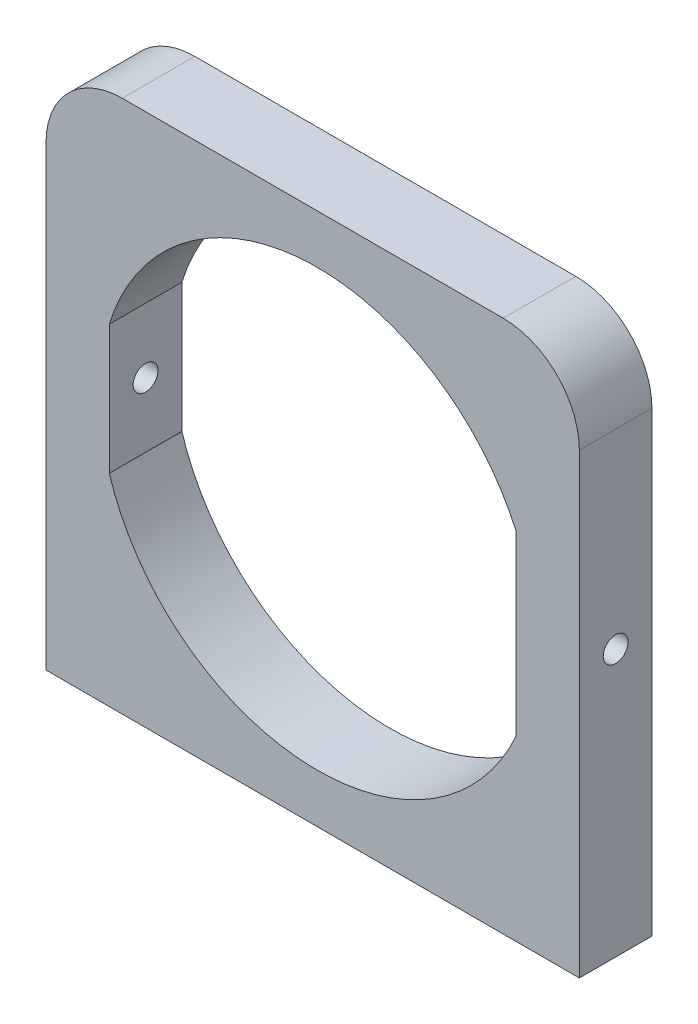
ISO-10303-21;
HEADER;
FILE_DESCRIPTION(('STEP AP214'),'2;1');
FILE_NAME('part.step','',(''),(''),'','','');
FILE_SCHEMA(('AUTOMOTIVE_DESIGN { 1 0 10303 214 1 1 1 1 }'));
ENDSEC;
DATA;
#1=APPLICATION_CONTEXT('core data for automotive mechanical design processes');
#2=APPLICATION_PROTOCOL_DEFINITION('international standard','automotive_design',2000,#1);
#3=PRODUCT_CONTEXT('',#1,'mechanical');
#4=PRODUCT('Part','Part','',(#3));
#5=PRODUCT_RELATED_PRODUCT_CATEGORY('part','',(#4));
#6=PRODUCT_DEFINITION_FORMATION('','',#4);
#7=PRODUCT_DEFINITION_CONTEXT('part definition',#1,'design');
#8=PRODUCT_DEFINITION('design','',#6,#7);
#9=PRODUCT_DEFINITION_SHAPE('','',#8);
#10=(LENGTH_UNIT() NAMED_UNIT(*) SI_UNIT(.MILLI.,.METRE.));
#11=(NAMED_UNIT(*) PLANE_ANGLE_UNIT() SI_UNIT($,.RADIAN.));
#12=(NAMED_UNIT(*) SI_UNIT($,.STERADIAN.) SOLID_ANGLE_UNIT());
#13=UNCERTAINTY_MEASURE_WITH_UNIT(LENGTH_MEASURE(1.E-05),#10,'distance_accuracy_value','');
#14=(GEOMETRIC_REPRESENTATION_CONTEXT(3) GLOBAL_UNCERTAINTY_ASSIGNED_CONTEXT((#13)) GLOBAL_UNIT_ASSIGNED_CONTEXT((#10,
#11,#12)) REPRESENTATION_CONTEXT('',''));
#15=CARTESIAN_POINT('',(0.,0.,0.));
#16=DIRECTION('',(0.,0.,1.));
#17=DIRECTION('',(1.,0.,0.));
#18=AXIS2_PLACEMENT_3D('',#15,#16,#17);
#19=CARTESIAN_POINT('',(-35.,0.,4.7625));
#20=DIRECTION('',(-1.,0.,0.));
#21=DIRECTION('',(0.,0.,1.));
#22=AXIS2_PLACEMENT_3D('',#19,#20,#21);
#23=CYLINDRICAL_SURFACE('',#22,1.63194999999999);
#24=CARTESIAN_POINT('',(26.7,0.,4.7625));
#25=DIRECTION('',(1.,0.,0.));
#26=DIRECTION('',(0.,1.,0.));
#27=AXIS2_PLACEMENT_3D('',#24,#25,#26);
#28=CIRCLE('',#27,1.63194999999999);
#29=CARTESIAN_POINT('',(26.7,1.63194999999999,4.7625));
#30=VERTEX_POINT('',#29);
#31=EDGE_CURVE('E149',#30,#30,#28,.T.);
#32=ORIENTED_EDGE('',*,*,#31,.F.);
#33=EDGE_LOOP('',(#32));
#34=FACE_BOUND('',#33,.T.);
#35=CARTESIAN_POINT('',(35.,0.,4.7625));
#36=DIRECTION('',(-1.,0.,0.));
#37=DIRECTION('',(0.,0.,1.));
#38=AXIS2_PLACEMENT_3D('',#35,#36,#37);
#39=CIRCLE('',#38,1.63194999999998);
#40=CARTESIAN_POINT('',(35.,0.,6.39444999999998));
#41=VERTEX_POINT('',#40);
#42=EDGE_CURVE('E203',#41,#41,#39,.T.);
#43=ORIENTED_EDGE('',*,*,#42,.F.);
#44=EDGE_LOOP('',(#43));
#45=FACE_BOUND('',#44,.T.);
#46=ADVANCED_FACE('F37',(#34,#45),#23,.F.);
#47=CARTESIAN_POINT('',(-35.,-35.,9.525));
#48=DIRECTION('',(1.,0.,0.));
#49=DIRECTION('',(0.,0.,-1.));
#50=AXIS2_PLACEMENT_3D('',#47,#48,#49);
#51=PLANE('',#50);
#52=CARTESIAN_POINT('',(-35.,0.,4.7625));
#53=DIRECTION('',(-1.,0.,0.));
#54=DIRECTION('',(0.,0.,1.));
#55=AXIS2_PLACEMENT_3D('',#52,#53,#54);
#56=CIRCLE('',#55,1.63194999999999);
#57=CARTESIAN_POINT('',(-35.,0.,6.39444999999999));
#58=VERTEX_POINT('',#57);
#59=EDGE_CURVE('E200',#58,#58,#56,.T.);
#60=ORIENTED_EDGE('',*,*,#59,.F.);
#61=EDGE_LOOP('',(#60));
#62=FACE_BOUND('',#61,.T.);
#63=DIRECTION('',(0.,-1.,0.));
#64=VECTOR('',#63,1.);
#65=CARTESIAN_POINT('',(-35.,-35.,9.525));
#66=LINE('',#65,#64);
#67=CARTESIAN_POINT('',(-35.,25.,9.525));
#68=VERTEX_POINT('',#67);
#69=CARTESIAN_POINT('',(-35.,-35.,9.525));
#70=VERTEX_POINT('',#69);
#71=EDGE_CURVE('E207',#68,#70,#66,.T.);
#72=ORIENTED_EDGE('',*,*,#71,.F.);
#73=DIRECTION('',(0.,0.,-1.));
#74=VECTOR('',#73,1.);
#75=CARTESIAN_POINT('',(-35.,25.,9.525));
#76=LINE('',#75,#74);
#77=CARTESIAN_POINT('',(-35.,25.,0.));
#78=VERTEX_POINT('',#77);
#79=EDGE_CURVE('E11',#68,#78,#76,.T.);
#80=ORIENTED_EDGE('',*,*,#79,.T.);
#81=DIRECTION('',(0.,-1.,0.));
#82=VECTOR('',#81,1.);
#83=CARTESIAN_POINT('',(-35.,-35.,0.));
#84=LINE('',#83,#82);
#85=CARTESIAN_POINT('',(-35.,-35.,0.));
#86=VERTEX_POINT('',#85);
#87=EDGE_CURVE('E206',#78,#86,#84,.T.);
#88=ORIENTED_EDGE('',*,*,#87,.T.);
#89=DIRECTION('',(0.,0.,-1.));
#90=VECTOR('',#89,1.);
#91=CARTESIAN_POINT('',(-35.,-35.,9.525));
#92=LINE('',#91,#90);
#93=EDGE_CURVE('E226',#70,#86,#92,.T.);
#94=ORIENTED_EDGE('',*,*,#93,.F.);
#95=EDGE_LOOP('',(#72,#80,#88,#94));
#96=FACE_BOUND('',#95,.T.);
#97=ADVANCED_FACE('F259',(#62,#96),#51,.F.);
#98=CARTESIAN_POINT('',(35.,-35.,9.525));
#99=DIRECTION('',(0.,1.,0.));
#100=DIRECTION('',(-1.,0.,0.));
#101=AXIS2_PLACEMENT_3D('',#98,#99,#100);
#102=PLANE('',#101);
#103=CARTESIAN_POINT('',(-15.95,-35.,4.7625));
#104=DIRECTION('',(0.,-1.,0.));
#105=DIRECTION('',(0.,0.,-1.));
#106=AXIS2_PLACEMENT_3D('',#103,#104,#105);
#107=CIRCLE('',#106,1.5875);
#108=CARTESIAN_POINT('',(-15.95,-35.,3.175));
#109=VERTEX_POINT('',#108);
#110=EDGE_CURVE('E176',#109,#109,#107,.T.);
#111=ORIENTED_EDGE('',*,*,#110,.F.);
#112=EDGE_LOOP('',(#111));
#113=FACE_BOUND('',#112,.T.);
#114=CARTESIAN_POINT('',(15.95,-35.,4.7625));
#115=DIRECTION('',(0.,-1.,0.));
#116=DIRECTION('',(0.,0.,-1.));
#117=AXIS2_PLACEMENT_3D('',#114,#115,#116);
#118=CIRCLE('',#117,1.5875);
#119=CARTESIAN_POINT('',(15.95,-35.,3.175));
#120=VERTEX_POINT('',#119);
#121=EDGE_CURVE('E182',#120,#120,#118,.T.);
#122=ORIENTED_EDGE('',*,*,#121,.F.);
#123=EDGE_LOOP('',(#122));
#124=FACE_BOUND('',#123,.T.);
#125=CARTESIAN_POINT('',(-28.65,-35.,4.7625));
#126=DIRECTION('',(0.,-1.,0.));
#127=DIRECTION('',(0.,0.,-1.));
#128=AXIS2_PLACEMENT_3D('',#125,#126,#127);
#129=CIRCLE('',#128,1.7272);
#130=CARTESIAN_POINT('',(-28.65,-35.,3.0353));
#131=VERTEX_POINT('',#130);
#132=EDGE_CURVE('E188',#131,#131,#129,.T.);
#133=ORIENTED_EDGE('',*,*,#132,.F.);
#134=EDGE_LOOP('',(#133));
#135=FACE_BOUND('',#134,.T.);
#136=CARTESIAN_POINT('',(28.65,-35.,4.7625));
#137=DIRECTION('',(0.,-1.,0.));
#138=DIRECTION('',(0.,0.,-1.));
#139=AXIS2_PLACEMENT_3D('',#136,#137,#138);
#140=CIRCLE('',#139,1.7272);
#141=CARTESIAN_POINT('',(28.65,-35.,3.0353));
#142=VERTEX_POINT('',#141);
#143=EDGE_CURVE('E194',#142,#142,#140,.T.);
#144=ORIENTED_EDGE('',*,*,#143,.F.);
#145=EDGE_LOOP('',(#144));
#146=FACE_BOUND('',#145,.T.);
#147=DIRECTION('',(1.,0.,0.));
#148=VECTOR('',#147,1.);
#149=CARTESIAN_POINT('',(35.,-35.,0.));
#150=LINE('',#149,#148);
#151=CARTESIAN_POINT('',(35.,-35.,0.));
#152=VERTEX_POINT('',#151);
#153=EDGE_CURVE('E218',#86,#152,#150,.T.);
#154=ORIENTED_EDGE('',*,*,#153,.T.);
#155=DIRECTION('',(0.,0.,-1.));
#156=VECTOR('',#155,1.);
#157=CARTESIAN_POINT('',(35.,-35.,9.525));
#158=LINE('',#157,#156);
#159=CARTESIAN_POINT('',(35.,-35.,9.525));
#160=VERTEX_POINT('',#159);
#161=EDGE_CURVE('E216',#160,#152,#158,.T.);
#162=ORIENTED_EDGE('',*,*,#161,.F.);
#163=DIRECTION('',(1.,0.,0.));
#164=VECTOR('',#163,1.);
#165=CARTESIAN_POINT('',(35.,-35.,9.525));
#166=LINE('',#165,#164);
#167=EDGE_CURVE('E209',#70,#160,#166,.T.);
#168=ORIENTED_EDGE('',*,*,#167,.F.);
#169=ORIENTED_EDGE('',*,*,#93,.T.);
#170=EDGE_LOOP('',(#154,#162,#168,#169));
#171=FACE_BOUND('',#170,.T.);
#172=ADVANCED_FACE('F255',(#113,#124,#135,#146,#171),#102,.F.);
#173=CARTESIAN_POINT('',(35.,-35.,9.525));
#174=DIRECTION('',(-1.,0.,0.));
#175=DIRECTION('',(0.,0.,1.));
#176=AXIS2_PLACEMENT_3D('',#173,#174,#175);
#177=PLANE('',#176);
#178=ORIENTED_EDGE('',*,*,#42,.T.);
#179=EDGE_LOOP('',(#178));
#180=FACE_BOUND('',#179,.T.);
#181=DIRECTION('',(0.,1.,0.));
#182=VECTOR('',#181,1.);
#183=CARTESIAN_POINT('',(35.,-35.,0.));
#184=LINE('',#183,#182);
#185=CARTESIAN_POINT('',(35.,25.,0.));
#186=VERTEX_POINT('',#185);
#187=EDGE_CURVE('E220',#152,#186,#184,.T.);
#188=ORIENTED_EDGE('',*,*,#187,.T.);
#189=DIRECTION('',(0.,0.,-1.));
#190=VECTOR('',#189,1.);
#191=CARTESIAN_POINT('',(35.,25.,9.525));
#192=LINE('',#191,#190);
#193=CARTESIAN_POINT('',(35.,25.,9.525));
#194=VERTEX_POINT('',#193);
#195=EDGE_CURVE('E60',#186,#194,#192,.F.);
#196=ORIENTED_EDGE('',*,*,#195,.T.);
#197=DIRECTION('',(0.,1.,0.));
#198=VECTOR('',#197,1.);
#199=CARTESIAN_POINT('',(35.,-35.,9.525));
#200=LINE('',#199,#198);
#201=EDGE_CURVE('E212',#160,#194,#200,.T.);
#202=ORIENTED_EDGE('',*,*,#201,.F.);
#203=ORIENTED_EDGE('',*,*,#161,.T.);
#204=EDGE_LOOP('',(#188,#196,#202,#203));
#205=FACE_BOUND('',#204,.T.);
#206=ADVANCED_FACE('F251',(#180,#205),#177,.F.);
#207=CARTESIAN_POINT('',(35.,35.,9.525));
#208=DIRECTION('',(0.,-1.,0.));
#209=DIRECTION('',(1.,0.,0.));
#210=AXIS2_PLACEMENT_3D('',#207,#208,#209);
#211=PLANE('',#210);
#212=DIRECTION('',(-1.,0.,0.));
#213=VECTOR('',#212,1.);
#214=CARTESIAN_POINT('',(35.,35.,9.525));
#215=LINE('',#214,#213);
#216=CARTESIAN_POINT('',(25.,35.,9.525));
#217=VERTEX_POINT('',#216);
#218=CARTESIAN_POINT('',(-25.,35.,9.525));
#219=VERTEX_POINT('',#218);
#220=EDGE_CURVE('E214',#217,#219,#215,.T.);
#221=ORIENTED_EDGE('',*,*,#220,.F.);
#222=DIRECTION('',(0.,0.,-1.));
#223=VECTOR('',#222,1.);
#224=CARTESIAN_POINT('',(25.,35.,9.525));
#225=LINE('',#224,#223);
#226=CARTESIAN_POINT('',(25.,35.,0.));
#227=VERTEX_POINT('',#226);
#228=EDGE_CURVE('E231',#217,#227,#225,.T.);
#229=ORIENTED_EDGE('',*,*,#228,.T.);
#230=DIRECTION('',(-1.,0.,0.));
#231=VECTOR('',#230,1.);
#232=CARTESIAN_POINT('',(35.,35.,0.));
#233=LINE('',#232,#231);
#234=CARTESIAN_POINT('',(-25.,35.,0.));
#235=VERTEX_POINT('',#234);
#236=EDGE_CURVE('E210',#227,#235,#233,.T.);
#237=ORIENTED_EDGE('',*,*,#236,.T.);
#238=DIRECTION('',(0.,0.,-1.));
#239=VECTOR('',#238,1.);
#240=CARTESIAN_POINT('',(-25.,35.,9.525));
#241=LINE('',#240,#239);
#242=EDGE_CURVE('E229',#235,#219,#241,.F.);
#243=ORIENTED_EDGE('',*,*,#242,.T.);
#244=EDGE_LOOP('',(#221,#229,#237,#243));
#245=FACE_BOUND('',#244,.T.);
#246=ADVANCED_FACE('F245',(#245),#211,.F.);
#247=CARTESIAN_POINT('',(0.,0.,9.525));
#248=DIRECTION('',(0.,0.,1.));
#249=DIRECTION('',(1.,0.,0.));
#250=AXIS2_PLACEMENT_3D('',#247,#248,#249);
#251=PLANE('',#250);
#252=CARTESIAN_POINT('',(0.593393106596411,0.,9.525));
#253=DIRECTION('',(0.,0.,1.));
#254=DIRECTION('',(1.,0.,0.));
#255=AXIS2_PLACEMENT_3D('',#252,#253,#254);
#256=CIRCLE('',#255,28.58);
#257=CARTESIAN_POINT('',(26.7,11.6301967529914,9.525));
#258=VERTEX_POINT('',#257);
#259=CARTESIAN_POINT('',(-26.7,8.47862563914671,9.525));
#260=VERTEX_POINT('',#259);
#261=EDGE_CURVE('E136',#258,#260,#256,.T.);
#262=ORIENTED_EDGE('',*,*,#261,.F.);
#263=DIRECTION('',(0.,1.,0.));
#264=VECTOR('',#263,1.);
#265=CARTESIAN_POINT('',(26.7,11.6301967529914,9.525));
#266=LINE('',#265,#264);
#267=CARTESIAN_POINT('',(26.7,-11.6301967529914,9.525));
#268=VERTEX_POINT('',#267);
#269=EDGE_CURVE('E141',#268,#258,#266,.T.);
#270=ORIENTED_EDGE('',*,*,#269,.F.);
#271=CARTESIAN_POINT('',(0.593393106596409,0.,9.525));
#272=DIRECTION('',(0.,0.,1.));
#273=DIRECTION('',(-1.,0.,0.));
#274=AXIS2_PLACEMENT_3D('',#271,#272,#273);
#275=CIRCLE('',#274,28.58);
#276=CARTESIAN_POINT('',(-26.7,-8.47862563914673,9.525));
#277=VERTEX_POINT('',#276);
#278=EDGE_CURVE('E164',#277,#268,#275,.T.);
#279=ORIENTED_EDGE('',*,*,#278,.F.);
#280=DIRECTION('',(0.,-1.,0.));
#281=VECTOR('',#280,1.);
#282=CARTESIAN_POINT('',(-26.7,8.47862563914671,9.525));
#283=LINE('',#282,#281);
#284=EDGE_CURVE('E157',#260,#277,#283,.T.);
#285=ORIENTED_EDGE('',*,*,#284,.F.);
#286=EDGE_LOOP('',(#262,#270,#279,#285));
#287=FACE_BOUND('',#286,.T.);
#288=ORIENTED_EDGE('',*,*,#201,.T.);
#289=CARTESIAN_POINT('',(25.,25.,9.525));
#290=DIRECTION('',(0.,0.,1.));
#291=DIRECTION('',(1.,0.,0.));
#292=AXIS2_PLACEMENT_3D('',#289,#290,#291);
#293=CIRCLE('',#292,10.);
#294=EDGE_CURVE('E45',#194,#217,#293,.T.);
#295=ORIENTED_EDGE('',*,*,#294,.T.);
#296=ORIENTED_EDGE('',*,*,#220,.T.);
#297=CARTESIAN_POINT('',(-25.,25.,9.525));
#298=DIRECTION('',(0.,0.,1.));
#299=DIRECTION('',(1.,0.,0.));
#300=AXIS2_PLACEMENT_3D('',#297,#298,#299);
#301=CIRCLE('',#300,10.);
#302=EDGE_CURVE('E52',#219,#68,#301,.T.);
#303=ORIENTED_EDGE('',*,*,#302,.T.);
#304=ORIENTED_EDGE('',*,*,#71,.T.);
#305=ORIENTED_EDGE('',*,*,#167,.T.);
#306=EDGE_LOOP('',(#288,#295,#296,#303,#304,#305));
#307=FACE_BOUND('',#306,.T.);
#308=ADVANCED_FACE('F241',(#287,#307),#251,.T.);
#309=CARTESIAN_POINT('',(0.,0.,0.));
#310=DIRECTION('',(0.,0.,1.));
#311=DIRECTION('',(1.,0.,0.));
#312=AXIS2_PLACEMENT_3D('',#309,#310,#311);
#313=PLANE('',#312);
#314=DIRECTION('',(0.,-1.,0.));
#315=VECTOR('',#314,1.);
#316=CARTESIAN_POINT('',(26.7,11.6301967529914,0.));
#317=LINE('',#316,#315);
#318=CARTESIAN_POINT('',(26.7,11.6301967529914,0.));
#319=VERTEX_POINT('',#318);
#320=CARTESIAN_POINT('',(26.7,-11.6301967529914,0.));
#321=VERTEX_POINT('',#320);
#322=EDGE_CURVE('E155',#319,#321,#317,.T.);
#323=ORIENTED_EDGE('',*,*,#322,.F.);
#324=CARTESIAN_POINT('',(0.593393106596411,0.,0.));
#325=DIRECTION('',(0.,0.,1.));
#326=DIRECTION('',(1.,0.,0.));
#327=AXIS2_PLACEMENT_3D('',#324,#325,#326);
#328=CIRCLE('',#327,28.58);
#329=CARTESIAN_POINT('',(-26.7,8.47862563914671,0.));
#330=VERTEX_POINT('',#329);
#331=EDGE_CURVE('E133',#330,#319,#328,.F.);
#332=ORIENTED_EDGE('',*,*,#331,.F.);
#333=DIRECTION('',(0.,1.,0.));
#334=VECTOR('',#333,1.);
#335=CARTESIAN_POINT('',(-26.7,8.47862563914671,0.));
#336=LINE('',#335,#334);
#337=CARTESIAN_POINT('',(-26.7,-8.47862563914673,0.));
#338=VERTEX_POINT('',#337);
#339=EDGE_CURVE('E145',#338,#330,#336,.T.);
#340=ORIENTED_EDGE('',*,*,#339,.F.);
#341=CARTESIAN_POINT('',(0.593393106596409,0.,0.));
#342=DIRECTION('',(0.,0.,1.));
#343=DIRECTION('',(1.,0.,0.));
#344=AXIS2_PLACEMENT_3D('',#341,#342,#343);
#345=CIRCLE('',#344,28.58);
#346=EDGE_CURVE('E159',#321,#338,#345,.F.);
#347=ORIENTED_EDGE('',*,*,#346,.F.);
#348=EDGE_LOOP('',(#323,#332,#340,#347));
#349=FACE_BOUND('',#348,.T.);
#350=ORIENTED_EDGE('',*,*,#236,.F.);
#351=CARTESIAN_POINT('',(25.,25.,0.));
#352=DIRECTION('',(0.,0.,1.));
#353=DIRECTION('',(1.,0.,0.));
#354=AXIS2_PLACEMENT_3D('',#351,#352,#353);
#355=CIRCLE('',#354,10.);
#356=EDGE_CURVE('E236',#227,#186,#355,.F.);
#357=ORIENTED_EDGE('',*,*,#356,.T.);
#358=ORIENTED_EDGE('',*,*,#187,.F.);
#359=ORIENTED_EDGE('',*,*,#153,.F.);
#360=ORIENTED_EDGE('',*,*,#87,.F.);
#361=CARTESIAN_POINT('',(-25.,25.,0.));
#362=DIRECTION('',(0.,0.,1.));
#363=DIRECTION('',(1.,0.,0.));
#364=AXIS2_PLACEMENT_3D('',#361,#362,#363);
#365=CIRCLE('',#364,10.);
#366=EDGE_CURVE('E234',#78,#235,#365,.F.);
#367=ORIENTED_EDGE('',*,*,#366,.T.);
#368=EDGE_LOOP('',(#350,#357,#358,#359,#360,#367));
#369=FACE_BOUND('',#368,.T.);
#370=ADVANCED_FACE('F152',(#349,#369),#313,.F.);
#371=CARTESIAN_POINT('',(-26.7,0.,4.7625));
#372=DIRECTION('',(-1.,0.,0.));
#373=DIRECTION('',(0.,-1.,0.));
#374=AXIS2_PLACEMENT_3D('',#371,#372,#373);
#375=CIRCLE('',#374,1.63194999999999);
#376=CARTESIAN_POINT('',(-26.7,-1.63194999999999,4.7625));
#377=VERTEX_POINT('',#376);
#378=EDGE_CURVE('E150',#377,#377,#375,.T.);
#379=ORIENTED_EDGE('',*,*,#378,.F.);
#380=EDGE_LOOP('',(#379));
#381=FACE_BOUND('',#380,.T.);
#382=ORIENTED_EDGE('',*,*,#59,.T.);
#383=EDGE_LOOP('',(#382));
#384=FACE_BOUND('',#383,.T.);
#385=ADVANCED_FACE('F269',(#381,#384),#23,.F.);
#386=CARTESIAN_POINT('',(28.65,-22.3,4.7625));
#387=DIRECTION('',(0.,-1.,0.));
#388=DIRECTION('',(0.,0.,-1.));
#389=AXIS2_PLACEMENT_3D('',#386,#387,#388);
#390=CONICAL_SURFACE('',#389,1.7272,1.02974425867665);
#391=CARTESIAN_POINT('',(28.65,-21.2621935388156,4.7625));
#392=VERTEX_POINT('',#391);
#393=VERTEX_LOOP('',#392);
#394=FACE_BOUND('',#393,.T.);
#395=CARTESIAN_POINT('',(28.65,-22.3,4.7625));
#396=DIRECTION('',(0.,-1.,0.));
#397=DIRECTION('',(0.,0.,-1.));
#398=AXIS2_PLACEMENT_3D('',#395,#396,#397);
#399=CIRCLE('',#398,1.7272);
#400=CARTESIAN_POINT('',(28.65,-22.3,3.0353));
#401=VERTEX_POINT('',#400);
#402=EDGE_CURVE('E197',#401,#401,#399,.T.);
#403=ORIENTED_EDGE('',*,*,#402,.T.);
#404=EDGE_LOOP('',(#403));
#405=FACE_BOUND('',#404,.T.);
#406=ADVANCED_FACE('F281',(#394,#405),#390,.F.);
#407=CARTESIAN_POINT('',(28.65,-35.,4.7625));
#408=DIRECTION('',(0.,-1.,0.));
#409=DIRECTION('',(0.,0.,-1.));
#410=AXIS2_PLACEMENT_3D('',#407,#408,#409);
#411=CYLINDRICAL_SURFACE('',#410,1.7272);
#412=ORIENTED_EDGE('',*,*,#402,.F.);
#413=EDGE_LOOP('',(#412));
#414=FACE_BOUND('',#413,.T.);
#415=ORIENTED_EDGE('',*,*,#143,.T.);
#416=EDGE_LOOP('',(#415));
#417=FACE_BOUND('',#416,.T.);
#418=ADVANCED_FACE('F287',(#414,#417),#411,.F.);
#419=CARTESIAN_POINT('',(-28.65,-22.3,4.7625));
#420=DIRECTION('',(0.,-1.,0.));
#421=DIRECTION('',(0.,0.,-1.));
#422=AXIS2_PLACEMENT_3D('',#419,#420,#421);
#423=CONICAL_SURFACE('',#422,1.7272,1.02974425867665);
#424=CARTESIAN_POINT('',(-28.65,-21.2621935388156,4.7625));
#425=VERTEX_POINT('',#424);
#426=VERTEX_LOOP('',#425);
#427=FACE_BOUND('',#426,.T.);
#428=CARTESIAN_POINT('',(-28.65,-22.3,4.7625));
#429=DIRECTION('',(0.,-1.,0.));
#430=DIRECTION('',(0.,0.,-1.));
#431=AXIS2_PLACEMENT_3D('',#428,#429,#430);
#432=CIRCLE('',#431,1.7272);
#433=CARTESIAN_POINT('',(-28.65,-22.3,3.0353));
#434=VERTEX_POINT('',#433);
#435=EDGE_CURVE('E191',#434,#434,#432,.T.);
#436=ORIENTED_EDGE('',*,*,#435,.T.);
#437=EDGE_LOOP('',(#436));
#438=FACE_BOUND('',#437,.T.);
#439=ADVANCED_FACE('F327',(#427,#438),#423,.F.);
#440=CARTESIAN_POINT('',(-28.65,-35.,4.7625));
#441=DIRECTION('',(0.,-1.,0.));
#442=DIRECTION('',(0.,0.,-1.));
#443=AXIS2_PLACEMENT_3D('',#440,#441,#442);
#444=CYLINDRICAL_SURFACE('',#443,1.7272);
#445=ORIENTED_EDGE('',*,*,#435,.F.);
#446=EDGE_LOOP('',(#445));
#447=FACE_BOUND('',#446,.T.);
#448=ORIENTED_EDGE('',*,*,#132,.T.);
#449=EDGE_LOOP('',(#448));
#450=FACE_BOUND('',#449,.T.);
#451=ADVANCED_FACE('F323',(#447,#450),#444,.F.);
#452=CARTESIAN_POINT('',(15.95,-28.65,4.7625));
#453=DIRECTION('',(0.,-1.,0.));
#454=DIRECTION('',(0.,0.,-1.));
#455=AXIS2_PLACEMENT_3D('',#452,#453,#454);
#456=CONICAL_SURFACE('',#455,1.5875,1.02974425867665);
#457=CARTESIAN_POINT('',(15.95,-27.6961337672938,4.7625));
#458=VERTEX_POINT('',#457);
#459=VERTEX_LOOP('',#458);
#460=FACE_BOUND('',#459,.T.);
#461=CARTESIAN_POINT('',(15.95,-28.65,4.7625));
#462=DIRECTION('',(0.,-1.,0.));
#463=DIRECTION('',(0.,0.,-1.));
#464=AXIS2_PLACEMENT_3D('',#461,#462,#463);
#465=CIRCLE('',#464,1.5875);
#466=CARTESIAN_POINT('',(15.95,-28.65,3.175));
#467=VERTEX_POINT('',#466);
#468=EDGE_CURVE('E185',#467,#467,#465,.T.);
#469=ORIENTED_EDGE('',*,*,#468,.T.);
#470=EDGE_LOOP('',(#469));
#471=FACE_BOUND('',#470,.T.);
#472=ADVANCED_FACE('F319',(#460,#471),#456,.F.);
#473=CARTESIAN_POINT('',(15.95,-35.,4.7625));
#474=DIRECTION('',(0.,-1.,0.));
#475=DIRECTION('',(0.,0.,-1.));
#476=AXIS2_PLACEMENT_3D('',#473,#474,#475);
#477=CYLINDRICAL_SURFACE('',#476,1.5875);
#478=ORIENTED_EDGE('',*,*,#468,.F.);
#479=EDGE_LOOP('',(#478));
#480=FACE_BOUND('',#479,.T.);
#481=ORIENTED_EDGE('',*,*,#121,.T.);
#482=EDGE_LOOP('',(#481));
#483=FACE_BOUND('',#482,.T.);
#484=ADVANCED_FACE('F315',(#480,#483),#477,.F.);
#485=CARTESIAN_POINT('',(-15.95,-28.65,4.7625));
#486=DIRECTION('',(0.,-1.,0.));
#487=DIRECTION('',(0.,0.,-1.));
#488=AXIS2_PLACEMENT_3D('',#485,#486,#487);
#489=CONICAL_SURFACE('',#488,1.5875,1.02974425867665);
#490=CARTESIAN_POINT('',(-15.95,-27.6961337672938,4.7625));
#491=VERTEX_POINT('',#490);
#492=VERTEX_LOOP('',#491);
#493=FACE_BOUND('',#492,.T.);
#494=CARTESIAN_POINT('',(-15.95,-28.65,4.7625));
#495=DIRECTION('',(0.,-1.,0.));
#496=DIRECTION('',(0.,0.,-1.));
#497=AXIS2_PLACEMENT_3D('',#494,#495,#496);
#498=CIRCLE('',#497,1.5875);
#499=CARTESIAN_POINT('',(-15.95,-28.65,3.175));
#500=VERTEX_POINT('',#499);
#501=EDGE_CURVE('E179',#500,#500,#498,.T.);
#502=ORIENTED_EDGE('',*,*,#501,.T.);
#503=EDGE_LOOP('',(#502));
#504=FACE_BOUND('',#503,.T.);
#505=ADVANCED_FACE('F311',(#493,#504),#489,.F.);
#506=CARTESIAN_POINT('',(-15.95,-35.,4.7625));
#507=DIRECTION('',(0.,-1.,0.));
#508=DIRECTION('',(0.,0.,-1.));
#509=AXIS2_PLACEMENT_3D('',#506,#507,#508);
#510=CYLINDRICAL_SURFACE('',#509,1.5875);
#511=ORIENTED_EDGE('',*,*,#501,.F.);
#512=EDGE_LOOP('',(#511));
#513=FACE_BOUND('',#512,.T.);
#514=ORIENTED_EDGE('',*,*,#110,.T.);
#515=EDGE_LOOP('',(#514));
#516=FACE_BOUND('',#515,.T.);
#517=ADVANCED_FACE('F308',(#513,#516),#510,.F.);
#518=CARTESIAN_POINT('',(0.593393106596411,0.,-0.000999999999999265));
#519=DIRECTION('',(0.,0.,1.));
#520=DIRECTION('',(1.,0.,0.));
#521=AXIS2_PLACEMENT_3D('',#518,#519,#520);
#522=CYLINDRICAL_SURFACE('',#521,28.58);
#523=ORIENTED_EDGE('',*,*,#331,.T.);
#524=DIRECTION('',(0.,0.,1.));
#525=VECTOR('',#524,1.);
#526=CARTESIAN_POINT('',(26.7,11.6301967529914,-0.000999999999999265));
#527=LINE('',#526,#525);
#528=EDGE_CURVE('E169',#319,#258,#527,.T.);
#529=ORIENTED_EDGE('',*,*,#528,.T.);
#530=ORIENTED_EDGE('',*,*,#261,.T.);
#531=DIRECTION('',(0.,0.,1.));
#532=VECTOR('',#531,1.);
#533=CARTESIAN_POINT('',(-26.7,8.47862563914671,-0.000999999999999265));
#534=LINE('',#533,#532);
#535=EDGE_CURVE('E129',#330,#260,#534,.T.);
#536=ORIENTED_EDGE('',*,*,#535,.F.);
#537=EDGE_LOOP('',(#523,#529,#530,#536));
#538=FACE_BOUND('',#537,.T.);
#539=ADVANCED_FACE('F131',(#538),#522,.F.);
#540=CARTESIAN_POINT('',(26.7,11.6301967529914,-0.000999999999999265));
#541=DIRECTION('',(1.,0.,0.));
#542=DIRECTION('',(0.,1.,0.));
#543=AXIS2_PLACEMENT_3D('',#540,#541,#542);
#544=PLANE('',#543);
#545=ORIENTED_EDGE('',*,*,#31,.T.);
#546=EDGE_LOOP('',(#545));
#547=FACE_BOUND('',#546,.T.);
#548=ORIENTED_EDGE('',*,*,#322,.T.);
#549=DIRECTION('',(0.,0.,1.));
#550=VECTOR('',#549,1.);
#551=CARTESIAN_POINT('',(26.7,-11.6301967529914,-0.000999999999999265));
#552=LINE('',#551,#550);
#553=EDGE_CURVE('E171',#321,#268,#552,.T.);
#554=ORIENTED_EDGE('',*,*,#553,.T.);
#555=ORIENTED_EDGE('',*,*,#269,.T.);
#556=ORIENTED_EDGE('',*,*,#528,.F.);
#557=EDGE_LOOP('',(#548,#554,#555,#556));
#558=FACE_BOUND('',#557,.T.);
#559=ADVANCED_FACE('F301',(#547,#558),#544,.F.);
#560=CARTESIAN_POINT('',(0.593393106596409,0.,-0.000999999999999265));
#561=DIRECTION('',(0.,0.,1.));
#562=DIRECTION('',(1.,0.,0.));
#563=AXIS2_PLACEMENT_3D('',#560,#561,#562);
#564=CYLINDRICAL_SURFACE('',#563,28.58);
#565=ORIENTED_EDGE('',*,*,#346,.T.);
#566=DIRECTION('',(0.,0.,1.));
#567=VECTOR('',#566,1.);
#568=CARTESIAN_POINT('',(-26.7,-8.47862563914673,-0.000999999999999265));
#569=LINE('',#568,#567);
#570=EDGE_CURVE('E140',#338,#277,#569,.T.);
#571=ORIENTED_EDGE('',*,*,#570,.T.);
#572=ORIENTED_EDGE('',*,*,#278,.T.);
#573=ORIENTED_EDGE('',*,*,#553,.F.);
#574=EDGE_LOOP('',(#565,#571,#572,#573));
#575=FACE_BOUND('',#574,.T.);
#576=ADVANCED_FACE('F296',(#575),#564,.F.);
#577=CARTESIAN_POINT('',(-26.7,8.47862563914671,-0.000999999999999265));
#578=DIRECTION('',(-1.,0.,0.));
#579=DIRECTION('',(0.,-1.,0.));
#580=AXIS2_PLACEMENT_3D('',#577,#578,#579);
#581=PLANE('',#580);
#582=ORIENTED_EDGE('',*,*,#378,.T.);
#583=EDGE_LOOP('',(#582));
#584=FACE_BOUND('',#583,.T.);
#585=ORIENTED_EDGE('',*,*,#339,.T.);
#586=ORIENTED_EDGE('',*,*,#535,.T.);
#587=ORIENTED_EDGE('',*,*,#284,.T.);
#588=ORIENTED_EDGE('',*,*,#570,.F.);
#589=EDGE_LOOP('',(#585,#586,#587,#588));
#590=FACE_BOUND('',#589,.T.);
#591=ADVANCED_FACE('F146',(#584,#590),#581,.F.);
#592=CARTESIAN_POINT('',(25.,25.,9.525));
#593=DIRECTION('',(0.,0.,-1.));
#594=DIRECTION('',(-1.,0.,0.));
#595=AXIS2_PLACEMENT_3D('',#592,#593,#594);
#596=CYLINDRICAL_SURFACE('',#595,10.);
#597=ORIENTED_EDGE('',*,*,#294,.F.);
#598=ORIENTED_EDGE('',*,*,#195,.F.);
#599=ORIENTED_EDGE('',*,*,#356,.F.);
#600=ORIENTED_EDGE('',*,*,#228,.F.);
#601=EDGE_LOOP('',(#597,#598,#599,#600));
#602=FACE_BOUND('',#601,.T.);
#603=ADVANCED_FACE('F248',(#602),#596,.T.);
#604=CARTESIAN_POINT('',(-25.,25.,9.525));
#605=DIRECTION('',(0.,0.,-1.));
#606=DIRECTION('',(-1.,0.,0.));
#607=AXIS2_PLACEMENT_3D('',#604,#605,#606);
#608=CYLINDRICAL_SURFACE('',#607,10.);
#609=ORIENTED_EDGE('',*,*,#302,.F.);
#610=ORIENTED_EDGE('',*,*,#242,.F.);
#611=ORIENTED_EDGE('',*,*,#366,.F.);
#612=ORIENTED_EDGE('',*,*,#79,.F.);
#613=EDGE_LOOP('',(#609,#610,#611,#612));
#614=FACE_BOUND('',#613,.T.);
#615=ADVANCED_FACE('F39',(#614),#608,.T.);
#616=CLOSED_SHELL('',(#46,#97,#172,#206,#246,#308,#370,#385,#406,#418,#439,#451,#472,#484,#505,
#517,#539,#559,#576,#591,#603,#615));
#617=MANIFOLD_SOLID_BREP('B2',#616);
#618=ADVANCED_BREP_SHAPE_REPRESENTATION('',(#18,#617),#14);
#619=SHAPE_DEFINITION_REPRESENTATION(#9,#618);
ENDSEC;
END-ISO-10303-21;
